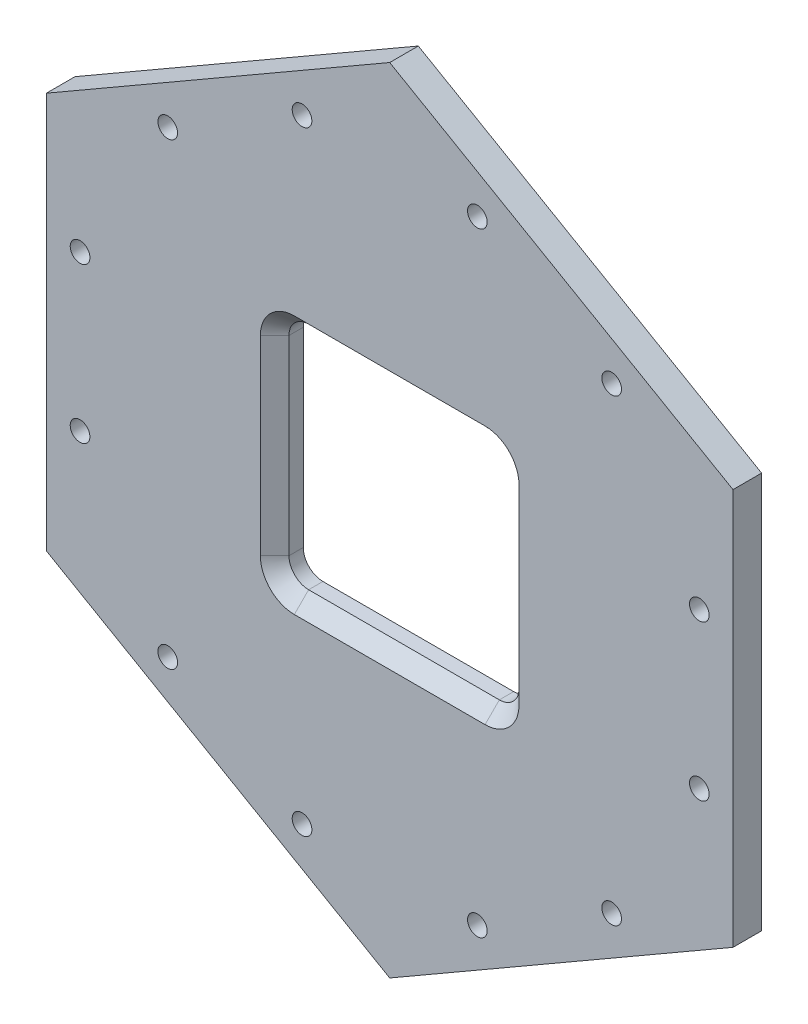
ISO-10303-21;
HEADER;
FILE_DESCRIPTION(('STEP AP214'),'2;1');
FILE_NAME('part.step','',(''),(''),'','','');
FILE_SCHEMA(('AUTOMOTIVE_DESIGN { 1 0 10303 214 1 1 1 1 }'));
ENDSEC;
DATA;
#1=APPLICATION_CONTEXT('core data for automotive mechanical design processes');
#2=APPLICATION_PROTOCOL_DEFINITION('international standard','automotive_design',2000,#1);
#3=PRODUCT_CONTEXT('',#1,'mechanical');
#4=PRODUCT('Part','Part','',(#3));
#5=PRODUCT_RELATED_PRODUCT_CATEGORY('part','',(#4));
#6=PRODUCT_DEFINITION_FORMATION('','',#4);
#7=PRODUCT_DEFINITION_CONTEXT('part definition',#1,'design');
#8=PRODUCT_DEFINITION('design','',#6,#7);
#9=PRODUCT_DEFINITION_SHAPE('','',#8);
#10=(LENGTH_UNIT() NAMED_UNIT(*) SI_UNIT(.MILLI.,.METRE.));
#11=(NAMED_UNIT(*) PLANE_ANGLE_UNIT() SI_UNIT($,.RADIAN.));
#12=(NAMED_UNIT(*) SI_UNIT($,.STERADIAN.) SOLID_ANGLE_UNIT());
#13=UNCERTAINTY_MEASURE_WITH_UNIT(LENGTH_MEASURE(1.E-05),#10,'distance_accuracy_value','');
#14=(GEOMETRIC_REPRESENTATION_CONTEXT(3) GLOBAL_UNCERTAINTY_ASSIGNED_CONTEXT((#13)) GLOBAL_UNIT_ASSIGNED_CONTEXT((#10,
#11,#12)) REPRESENTATION_CONTEXT('',''));
#15=CARTESIAN_POINT('',(0.,0.,0.));
#16=DIRECTION('',(0.,0.,1.));
#17=DIRECTION('',(1.,0.,0.));
#18=AXIS2_PLACEMENT_3D('',#15,#16,#17);
#19=CARTESIAN_POINT('',(-228.600000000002,131.982271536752,-9.52500000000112));
#20=DIRECTION('',(-1.,0.,0.));
#21=DIRECTION('',(0.,-1.,0.));
#22=AXIS2_PLACEMENT_3D('',#19,#20,#21);
#23=PLANE('',#22);
#24=DIRECTION('',(0.,-1.,0.));
#25=VECTOR('',#24,1.);
#26=CARTESIAN_POINT('',(-228.600000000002,131.982271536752,9.52499999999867));
#27=LINE('',#26,#25);
#28=CARTESIAN_POINT('',(-228.600000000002,131.982271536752,9.52499999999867));
#29=VERTEX_POINT('',#28);
#30=CARTESIAN_POINT('',(-228.600000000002,-131.982271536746,9.52499999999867));
#31=VERTEX_POINT('',#30);
#32=EDGE_CURVE('E298',#29,#31,#27,.T.);
#33=ORIENTED_EDGE('',*,*,#32,.F.);
#34=DIRECTION('',(0.,0.,1.));
#35=VECTOR('',#34,1.);
#36=CARTESIAN_POINT('',(-228.600000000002,131.982271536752,-9.52500000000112));
#37=LINE('',#36,#35);
#38=CARTESIAN_POINT('',(-228.600000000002,131.982271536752,-9.52500000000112));
#39=VERTEX_POINT('',#38);
#40=EDGE_CURVE('E366',#39,#29,#37,.T.);
#41=ORIENTED_EDGE('',*,*,#40,.F.);
#42=DIRECTION('',(0.,-1.,0.));
#43=VECTOR('',#42,1.);
#44=CARTESIAN_POINT('',(-228.600000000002,131.982271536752,-9.52500000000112));
#45=LINE('',#44,#43);
#46=CARTESIAN_POINT('',(-228.600000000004,-131.982271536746,-9.52500000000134));
#47=VERTEX_POINT('',#46);
#48=EDGE_CURVE('E318',#39,#47,#45,.T.);
#49=ORIENTED_EDGE('',*,*,#48,.T.);
#50=DIRECTION('',(0.,0.,1.));
#51=VECTOR('',#50,1.);
#52=CARTESIAN_POINT('',(-228.600000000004,-131.982271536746,-9.52500000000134));
#53=LINE('',#52,#51);
#54=EDGE_CURVE('E343',#47,#31,#53,.T.);
#55=ORIENTED_EDGE('',*,*,#54,.T.);
#56=EDGE_LOOP('',(#33,#41,#49,#55));
#57=FACE_BOUND('',#56,.T.);
#58=ADVANCED_FACE('F109',(#57),#23,.T.);
#59=CARTESIAN_POINT('',(-4.44089209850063E-13,263.964543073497,-9.52500000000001));
#60=DIRECTION('',(-0.5,0.86602540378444,0.));
#61=DIRECTION('',(-0.866025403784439,-0.500000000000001,0.));
#62=AXIS2_PLACEMENT_3D('',#59,#60,#61);
#63=PLANE('',#62);
#64=DIRECTION('',(-0.866025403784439,-0.500000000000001,0.));
#65=VECTOR('',#64,1.);
#66=CARTESIAN_POINT('',(-4.66293670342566E-12,263.964543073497,9.52500000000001));
#67=LINE('',#66,#65);
#68=CARTESIAN_POINT('',(-4.66293670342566E-12,263.964543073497,9.52500000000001));
#69=VERTEX_POINT('',#68);
#70=EDGE_CURVE('E323',#69,#29,#67,.T.);
#71=ORIENTED_EDGE('',*,*,#70,.F.);
#72=DIRECTION('',(0.,0.,1.));
#73=VECTOR('',#72,1.);
#74=CARTESIAN_POINT('',(-4.44089209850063E-13,263.964543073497,-9.52500000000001));
#75=LINE('',#74,#73);
#76=CARTESIAN_POINT('',(-4.44089209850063E-13,263.964543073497,-9.52500000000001));
#77=VERTEX_POINT('',#76);
#78=EDGE_CURVE('E369',#77,#69,#75,.T.);
#79=ORIENTED_EDGE('',*,*,#78,.F.);
#80=DIRECTION('',(-0.866025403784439,-0.500000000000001,0.));
#81=VECTOR('',#80,1.);
#82=CARTESIAN_POINT('',(-4.44089209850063E-13,263.964543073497,-9.52500000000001));
#83=LINE('',#82,#81);
#84=EDGE_CURVE('E339',#77,#39,#83,.T.);
#85=ORIENTED_EDGE('',*,*,#84,.T.);
#86=ORIENTED_EDGE('',*,*,#40,.T.);
#87=EDGE_LOOP('',(#71,#79,#85,#86));
#88=FACE_BOUND('',#87,.T.);
#89=ADVANCED_FACE('F577',(#88),#63,.T.);
#90=CARTESIAN_POINT('',(228.599999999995,131.982271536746,-9.52499999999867));
#91=DIRECTION('',(0.5,0.86602540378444,0.));
#92=DIRECTION('',(-0.866025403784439,0.500000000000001,0.));
#93=AXIS2_PLACEMENT_3D('',#90,#91,#92);
#94=PLANE('',#93);
#95=DIRECTION('',(-0.866025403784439,0.500000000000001,0.));
#96=VECTOR('',#95,1.);
#97=CARTESIAN_POINT('',(228.6,131.982271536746,9.52500000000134));
#98=LINE('',#97,#96);
#99=CARTESIAN_POINT('',(228.6,131.982271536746,9.52500000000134));
#100=VERTEX_POINT('',#99);
#101=EDGE_CURVE('E359',#100,#69,#98,.T.);
#102=ORIENTED_EDGE('',*,*,#101,.F.);
#103=DIRECTION('',(0.,0.,1.));
#104=VECTOR('',#103,1.);
#105=CARTESIAN_POINT('',(228.599999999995,131.982271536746,-9.52499999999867));
#106=LINE('',#105,#104);
#107=CARTESIAN_POINT('',(228.599999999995,131.982271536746,-9.52499999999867));
#108=VERTEX_POINT('',#107);
#109=EDGE_CURVE('E372',#108,#100,#106,.T.);
#110=ORIENTED_EDGE('',*,*,#109,.F.);
#111=DIRECTION('',(-0.866025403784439,0.500000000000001,0.));
#112=VECTOR('',#111,1.);
#113=CARTESIAN_POINT('',(228.599999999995,131.982271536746,-9.52499999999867));
#114=LINE('',#113,#112);
#115=EDGE_CURVE('E335',#108,#77,#114,.T.);
#116=ORIENTED_EDGE('',*,*,#115,.T.);
#117=ORIENTED_EDGE('',*,*,#78,.T.);
#118=EDGE_LOOP('',(#102,#110,#116,#117));
#119=FACE_BOUND('',#118,.T.);
#120=ADVANCED_FACE('F574',(#119),#94,.T.);
#121=CARTESIAN_POINT('',(228.599999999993,-131.982271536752,-9.52499999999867));
#122=DIRECTION('',(1.,0.,0.));
#123=DIRECTION('',(0.,0.,-1.));
#124=AXIS2_PLACEMENT_3D('',#121,#122,#123);
#125=PLANE('',#124);
#126=DIRECTION('',(0.,1.,0.));
#127=VECTOR('',#126,1.);
#128=CARTESIAN_POINT('',(228.599999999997,-131.982271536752,9.52500000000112));
#129=LINE('',#128,#127);
#130=CARTESIAN_POINT('',(228.599999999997,-131.982271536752,9.52500000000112));
#131=VERTEX_POINT('',#130);
#132=EDGE_CURVE('E355',#131,#100,#129,.T.);
#133=ORIENTED_EDGE('',*,*,#132,.F.);
#134=DIRECTION('',(0.,0.,1.));
#135=VECTOR('',#134,1.);
#136=CARTESIAN_POINT('',(228.599999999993,-131.982271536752,-9.52499999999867));
#137=LINE('',#136,#135);
#138=CARTESIAN_POINT('',(228.599999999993,-131.982271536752,-9.52499999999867));
#139=VERTEX_POINT('',#138);
#140=EDGE_CURVE('E375',#139,#131,#137,.T.);
#141=ORIENTED_EDGE('',*,*,#140,.F.);
#142=DIRECTION('',(0.,1.,0.));
#143=VECTOR('',#142,1.);
#144=CARTESIAN_POINT('',(228.599999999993,-131.982271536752,-9.52499999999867));
#145=LINE('',#144,#143);
#146=EDGE_CURVE('E331',#139,#108,#145,.T.);
#147=ORIENTED_EDGE('',*,*,#146,.T.);
#148=ORIENTED_EDGE('',*,*,#109,.T.);
#149=EDGE_LOOP('',(#133,#141,#147,#148));
#150=FACE_BOUND('',#149,.T.);
#151=ADVANCED_FACE('F570',(#150),#125,.T.);
#152=CARTESIAN_POINT('',(-6.66133814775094E-13,-263.964543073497,-9.52500000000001));
#153=DIRECTION('',(0.5,-0.86602540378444,0.));
#154=DIRECTION('',(0.866025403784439,0.500000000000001,0.));
#155=AXIS2_PLACEMENT_3D('',#152,#153,#154);
#156=PLANE('',#155);
#157=DIRECTION('',(0.866025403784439,0.500000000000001,0.));
#158=VECTOR('',#157,1.);
#159=CARTESIAN_POINT('',(-4.66293670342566E-12,-263.964543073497,9.52500000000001));
#160=LINE('',#159,#158);
#161=CARTESIAN_POINT('',(-4.66293670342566E-12,-263.964543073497,9.52500000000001));
#162=VERTEX_POINT('',#161);
#163=EDGE_CURVE('E351',#162,#131,#160,.T.);
#164=ORIENTED_EDGE('',*,*,#163,.F.);
#165=DIRECTION('',(0.,0.,1.));
#166=VECTOR('',#165,1.);
#167=CARTESIAN_POINT('',(-6.66133814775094E-13,-263.964543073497,-9.52500000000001));
#168=LINE('',#167,#166);
#169=CARTESIAN_POINT('',(-6.66133814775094E-13,-263.964543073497,-9.52500000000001));
#170=VERTEX_POINT('',#169);
#171=EDGE_CURVE('E378',#170,#162,#168,.T.);
#172=ORIENTED_EDGE('',*,*,#171,.F.);
#173=DIRECTION('',(0.866025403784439,0.500000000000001,0.));
#174=VECTOR('',#173,1.);
#175=CARTESIAN_POINT('',(-6.66133814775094E-13,-263.964543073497,-9.52500000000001));
#176=LINE('',#175,#174);
#177=EDGE_CURVE('E327',#170,#139,#176,.T.);
#178=ORIENTED_EDGE('',*,*,#177,.T.);
#179=ORIENTED_EDGE('',*,*,#140,.T.);
#180=EDGE_LOOP('',(#164,#172,#178,#179));
#181=FACE_BOUND('',#180,.T.);
#182=ADVANCED_FACE('F566',(#181),#156,.T.);
#183=CARTESIAN_POINT('',(-228.600000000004,-131.982271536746,-9.52500000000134));
#184=DIRECTION('',(-0.5,-0.86602540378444,0.));
#185=DIRECTION('',(0.866025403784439,-0.500000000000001,0.));
#186=AXIS2_PLACEMENT_3D('',#183,#184,#185);
#187=PLANE('',#186);
#188=DIRECTION('',(0.866025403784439,-0.500000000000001,0.));
#189=VECTOR('',#188,1.);
#190=CARTESIAN_POINT('',(-228.600000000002,-131.982271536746,9.52499999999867));
#191=LINE('',#190,#189);
#192=EDGE_CURVE('E347',#31,#162,#191,.T.);
#193=ORIENTED_EDGE('',*,*,#192,.F.);
#194=ORIENTED_EDGE('',*,*,#54,.F.);
#195=DIRECTION('',(0.866025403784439,-0.500000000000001,0.));
#196=VECTOR('',#195,1.);
#197=CARTESIAN_POINT('',(-228.600000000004,-131.982271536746,-9.52500000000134));
#198=LINE('',#197,#196);
#199=EDGE_CURVE('E322',#47,#170,#198,.T.);
#200=ORIENTED_EDGE('',*,*,#199,.T.);
#201=ORIENTED_EDGE('',*,*,#171,.T.);
#202=EDGE_LOOP('',(#193,#194,#200,#201));
#203=FACE_BOUND('',#202,.T.);
#204=ADVANCED_FACE('F562',(#203),#187,.T.);
#205=CARTESIAN_POINT('',(-4.44089209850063E-13,0.,-9.52500000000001));
#206=DIRECTION('',(0.,0.,1.));
#207=DIRECTION('',(1.,0.,0.));
#208=AXIS2_PLACEMENT_3D('',#205,#206,#207);
#209=PLANE('',#208);
#210=CARTESIAN_POINT('',(-58.3783411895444,-204.36743671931,-9.52500000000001));
#211=DIRECTION('',(0.,0.,1.));
#212=DIRECTION('',(1.,0.,0.));
#213=AXIS2_PLACEMENT_3D('',#210,#211,#212);
#214=CIRCLE('',#213,6.54843750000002);
#215=CARTESIAN_POINT('',(-51.8299036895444,-204.36743671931,-9.52500000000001));
#216=VERTEX_POINT('',#215);
#217=EDGE_CURVE('E497',#216,#216,#214,.T.);
#218=ORIENTED_EDGE('',*,*,#217,.T.);
#219=EDGE_LOOP('',(#218));
#220=FACE_BOUND('',#219,.T.);
#221=CARTESIAN_POINT('',(-206.176562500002,51.6265918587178,-9.52499999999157));
#222=DIRECTION('',(0.,0.,1.));
#223=DIRECTION('',(1.,0.,0.));
#224=AXIS2_PLACEMENT_3D('',#221,#222,#223);
#225=CIRCLE('',#224,6.5484375);
#226=CARTESIAN_POINT('',(-199.628125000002,51.6265918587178,-9.52499999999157));
#227=VERTEX_POINT('',#226);
#228=EDGE_CURVE('E488',#227,#227,#225,.T.);
#229=ORIENTED_EDGE('',*,*,#228,.T.);
#230=EDGE_LOOP('',(#229));
#231=FACE_BOUND('',#230,.T.);
#232=CARTESIAN_POINT('',(-206.176562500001,-51.6265918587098,-9.52499999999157));
#233=DIRECTION('',(0.,0.,1.));
#234=DIRECTION('',(1.,0.,0.));
#235=AXIS2_PLACEMENT_3D('',#232,#233,#234);
#236=CIRCLE('',#235,6.5484375);
#237=CARTESIAN_POINT('',(-199.628125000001,-51.6265918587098,-9.52499999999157));
#238=VERTEX_POINT('',#237);
#239=EDGE_CURVE('E479',#238,#238,#236,.T.);
#240=ORIENTED_EDGE('',*,*,#239,.T.);
#241=EDGE_LOOP('',(#240));
#242=FACE_BOUND('',#241,.T.);
#243=CARTESIAN_POINT('',(-58.3783411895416,204.367436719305,-9.52500000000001));
#244=DIRECTION('',(0.,0.,1.));
#245=DIRECTION('',(1.,0.,0.));
#246=AXIS2_PLACEMENT_3D('',#243,#244,#245);
#247=CIRCLE('',#246,6.5484375);
#248=CARTESIAN_POINT('',(-51.8299036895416,204.367436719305,-9.52500000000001));
#249=VERTEX_POINT('',#248);
#250=EDGE_CURVE('E489',#249,#249,#247,.T.);
#251=ORIENTED_EDGE('',*,*,#250,.T.);
#252=EDGE_LOOP('',(#251));
#253=FACE_BOUND('',#252,.T.);
#254=CARTESIAN_POINT('',(206.176562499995,51.6265918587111,-9.52500000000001));
#255=DIRECTION('',(0.,0.,1.));
#256=DIRECTION('',(1.,0.,0.));
#257=AXIS2_PLACEMENT_3D('',#254,#255,#256);
#258=CIRCLE('',#257,6.5484375);
#259=CARTESIAN_POINT('',(212.724999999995,51.6265918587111,-9.52500000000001));
#260=VERTEX_POINT('',#259);
#261=EDGE_CURVE('E529',#260,#260,#258,.T.);
#262=ORIENTED_EDGE('',*,*,#261,.T.);
#263=EDGE_LOOP('',(#262));
#264=FACE_BOUND('',#263,.T.);
#265=CARTESIAN_POINT('',(58.378341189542,-204.367436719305,-9.52500000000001));
#266=DIRECTION('',(0.,0.,1.));
#267=DIRECTION('',(1.,0.,0.));
#268=AXIS2_PLACEMENT_3D('',#265,#266,#267);
#269=CIRCLE('',#268,6.54843750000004);
#270=CARTESIAN_POINT('',(64.926778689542,-204.367436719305,-9.52500000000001));
#271=VERTEX_POINT('',#270);
#272=EDGE_CURVE('E522',#271,#271,#269,.T.);
#273=ORIENTED_EDGE('',*,*,#272,.T.);
#274=EDGE_LOOP('',(#273));
#275=FACE_BOUND('',#274,.T.);
#276=CARTESIAN_POINT('',(147.798221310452,-152.740844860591,-9.52499999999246));
#277=DIRECTION('',(0.,0.,1.));
#278=DIRECTION('',(1.,0.,0.));
#279=AXIS2_PLACEMENT_3D('',#276,#277,#278);
#280=CIRCLE('',#279,6.54843750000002);
#281=CARTESIAN_POINT('',(154.346658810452,-152.740844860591,-9.52499999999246));
#282=VERTEX_POINT('',#281);
#283=EDGE_CURVE('E513',#282,#282,#280,.T.);
#284=ORIENTED_EDGE('',*,*,#283,.T.);
#285=EDGE_LOOP('',(#284));
#286=FACE_BOUND('',#285,.T.);
#287=CARTESIAN_POINT('',(-147.798221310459,-152.740844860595,-9.52499999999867));
#288=DIRECTION('',(0.,0.,1.));
#289=DIRECTION('',(1.,0.,0.));
#290=AXIS2_PLACEMENT_3D('',#287,#288,#289);
#291=CIRCLE('',#290,6.54843750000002);
#292=CARTESIAN_POINT('',(-141.249783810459,-152.740844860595,-9.52499999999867));
#293=VERTEX_POINT('',#292);
#294=EDGE_CURVE('E506',#293,#293,#291,.T.);
#295=ORIENTED_EDGE('',*,*,#294,.T.);
#296=EDGE_LOOP('',(#295));
#297=FACE_BOUND('',#296,.T.);
#298=CARTESIAN_POINT('',(-147.798221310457,152.740844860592,-9.52499999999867));
#299=DIRECTION('',(0.,0.,1.));
#300=DIRECTION('',(1.,0.,0.));
#301=AXIS2_PLACEMENT_3D('',#298,#299,#300);
#302=CIRCLE('',#301,6.54843750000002);
#303=CARTESIAN_POINT('',(-141.249783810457,152.740844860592,-9.52499999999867));
#304=VERTEX_POINT('',#303);
#305=EDGE_CURVE('E869',#304,#304,#302,.T.);
#306=ORIENTED_EDGE('',*,*,#305,.T.);
#307=EDGE_LOOP('',(#306));
#308=FACE_BOUND('',#307,.T.);
#309=CARTESIAN_POINT('',(147.798221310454,152.740844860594,-9.52499999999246));
#310=DIRECTION('',(0.,0.,1.));
#311=DIRECTION('',(1.,0.,0.));
#312=AXIS2_PLACEMENT_3D('',#309,#310,#311);
#313=CIRCLE('',#312,6.5484375);
#314=CARTESIAN_POINT('',(154.346658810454,152.740844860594,-9.52499999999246));
#315=VERTEX_POINT('',#314);
#316=EDGE_CURVE('E473',#315,#315,#313,.T.);
#317=ORIENTED_EDGE('',*,*,#316,.T.);
#318=EDGE_LOOP('',(#317));
#319=FACE_BOUND('',#318,.T.);
#320=CARTESIAN_POINT('',(58.3783411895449,204.367436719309,-9.52500000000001));
#321=DIRECTION('',(0.,0.,1.));
#322=DIRECTION('',(1.,0.,0.));
#323=AXIS2_PLACEMENT_3D('',#320,#321,#322);
#324=CIRCLE('',#323,6.5484375);
#325=CARTESIAN_POINT('',(64.9267786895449,204.367436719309,-9.52500000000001));
#326=VERTEX_POINT('',#325);
#327=EDGE_CURVE('E458',#326,#326,#324,.T.);
#328=ORIENTED_EDGE('',*,*,#327,.T.);
#329=EDGE_LOOP('',(#328));
#330=FACE_BOUND('',#329,.T.);
#331=CARTESIAN_POINT('',(206.176562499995,-51.6265918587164,-9.52500000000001));
#332=DIRECTION('',(0.,0.,1.));
#333=DIRECTION('',(1.,0.,0.));
#334=AXIS2_PLACEMENT_3D('',#331,#332,#333);
#335=CIRCLE('',#334,6.5484375);
#336=CARTESIAN_POINT('',(212.724999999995,-51.6265918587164,-9.52500000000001));
#337=VERTEX_POINT('',#336);
#338=EDGE_CURVE('E267',#337,#337,#335,.T.);
#339=ORIENTED_EDGE('',*,*,#338,.T.);
#340=EDGE_LOOP('',(#339));
#341=FACE_BOUND('',#340,.T.);
#342=DIRECTION('',(0.,-1.,0.));
#343=VECTOR('',#342,1.);
#344=CARTESIAN_POINT('',(-76.5810000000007,63.5000000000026,-9.52499999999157));
#345=LINE('',#344,#343);
#346=CARTESIAN_POINT('',(-76.5810000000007,63.5000000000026,-9.52499999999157));
#347=VERTEX_POINT('',#346);
#348=CARTESIAN_POINT('',(-76.5810000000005,-63.4999999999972,-9.52499999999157));
#349=VERTEX_POINT('',#348);
#350=EDGE_CURVE('E250',#347,#349,#345,.T.);
#351=ORIENTED_EDGE('',*,*,#350,.T.);
#352=CARTESIAN_POINT('',(-63.5000000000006,-63.4999999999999,-9.52500000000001));
#353=DIRECTION('',(0.,0.,1.));
#354=DIRECTION('',(1.,0.,0.));
#355=AXIS2_PLACEMENT_3D('',#352,#353,#354);
#356=CIRCLE('',#355,13.081);
#357=CARTESIAN_POINT('',(-63.5000000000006,-76.5810000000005,-9.52500000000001));
#358=VERTEX_POINT('',#357);
#359=EDGE_CURVE('E243',#349,#358,#356,.T.);
#360=ORIENTED_EDGE('',*,*,#359,.T.);
#361=DIRECTION('',(1.,0.,0.));
#362=VECTOR('',#361,1.);
#363=CARTESIAN_POINT('',(-63.5000000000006,-76.5810000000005,-9.52500000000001));
#364=LINE('',#363,#362);
#365=CARTESIAN_POINT('',(63.4999999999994,-76.581,-9.52500000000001));
#366=VERTEX_POINT('',#365);
#367=EDGE_CURVE('E254',#358,#366,#364,.T.);
#368=ORIENTED_EDGE('',*,*,#367,.T.);
#369=CARTESIAN_POINT('',(63.4999999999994,-63.5000000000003,-9.52500000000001));
#370=DIRECTION('',(0.,0.,1.));
#371=DIRECTION('',(1.,0.,0.));
#372=AXIS2_PLACEMENT_3D('',#369,#370,#371);
#373=CIRCLE('',#372,13.081);
#374=CARTESIAN_POINT('',(76.5809999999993,-63.5000000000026,-9.52500000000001));
#375=VERTEX_POINT('',#374);
#376=EDGE_CURVE('E260',#366,#375,#373,.T.);
#377=ORIENTED_EDGE('',*,*,#376,.T.);
#378=DIRECTION('',(0.,1.,0.));
#379=VECTOR('',#378,1.);
#380=CARTESIAN_POINT('',(76.5809999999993,-63.5000000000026,-9.52500000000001));
#381=LINE('',#380,#379);
#382=CARTESIAN_POINT('',(76.5809999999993,63.4999999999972,-9.52500000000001));
#383=VERTEX_POINT('',#382);
#384=EDGE_CURVE('E278',#375,#383,#381,.T.);
#385=ORIENTED_EDGE('',*,*,#384,.T.);
#386=CARTESIAN_POINT('',(63.4999999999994,63.4999999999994,-9.52500000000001));
#387=DIRECTION('',(0.,0.,1.));
#388=DIRECTION('',(1.,0.,0.));
#389=AXIS2_PLACEMENT_3D('',#386,#387,#388);
#390=CIRCLE('',#389,13.081);
#391=CARTESIAN_POINT('',(63.4999999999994,76.581,-9.52500000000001));
#392=VERTEX_POINT('',#391);
#393=EDGE_CURVE('E282',#383,#392,#390,.T.);
#394=ORIENTED_EDGE('',*,*,#393,.T.);
#395=DIRECTION('',(-1.,0.,0.));
#396=VECTOR('',#395,1.);
#397=CARTESIAN_POINT('',(63.4999999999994,76.581,-9.52500000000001));
#398=LINE('',#397,#396);
#399=CARTESIAN_POINT('',(-63.5000000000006,76.5809999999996,-9.52500000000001));
#400=VERTEX_POINT('',#399);
#401=EDGE_CURVE('E286',#392,#400,#398,.T.);
#402=ORIENTED_EDGE('',*,*,#401,.T.);
#403=CARTESIAN_POINT('',(-63.5000000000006,63.4999999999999,-9.52500000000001));
#404=DIRECTION('',(0.,0.,1.));
#405=DIRECTION('',(1.,0.,0.));
#406=AXIS2_PLACEMENT_3D('',#403,#404,#405);
#407=CIRCLE('',#406,13.081);
#408=EDGE_CURVE('E290',#400,#347,#407,.T.);
#409=ORIENTED_EDGE('',*,*,#408,.T.);
#410=EDGE_LOOP('',(#351,#360,#368,#377,#385,#394,#402,#409));
#411=FACE_BOUND('',#410,.T.);
#412=ORIENTED_EDGE('',*,*,#48,.F.);
#413=ORIENTED_EDGE('',*,*,#84,.F.);
#414=ORIENTED_EDGE('',*,*,#115,.F.);
#415=ORIENTED_EDGE('',*,*,#146,.F.);
#416=ORIENTED_EDGE('',*,*,#177,.F.);
#417=ORIENTED_EDGE('',*,*,#199,.F.);
#418=EDGE_LOOP('',(#412,#413,#414,#415,#416,#417));
#419=FACE_BOUND('',#418,.T.);
#420=ADVANCED_FACE('F262',(#220,#231,#242,#253,#264,#275,#286,#297,#308,#319,#330,#341,#411,
#419),#209,.F.);
#421=CARTESIAN_POINT('',(-4.66293670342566E-12,0.,9.52500000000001));
#422=DIRECTION('',(0.,0.,1.));
#423=DIRECTION('',(1.,0.,0.));
#424=AXIS2_PLACEMENT_3D('',#421,#422,#423);
#425=PLANE('',#424);
#426=DIRECTION('',(-1.,0.,0.));
#427=VECTOR('',#426,1.);
#428=CARTESIAN_POINT('',(-63.5000000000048,-86.1059999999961,9.52500000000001));
#429=LINE('',#428,#427);
#430=CARTESIAN_POINT('',(63.4999999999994,-86.105999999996,9.52500000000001));
#431=VERTEX_POINT('',#430);
#432=CARTESIAN_POINT('',(-63.5000000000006,-86.1059999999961,9.52500000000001));
#433=VERTEX_POINT('',#432);
#434=EDGE_CURVE('E403',#431,#433,#429,.T.);
#435=ORIENTED_EDGE('',*,*,#434,.T.);
#436=CARTESIAN_POINT('',(-63.5000000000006,-63.4999999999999,9.52500000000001));
#437=DIRECTION('',(0.,0.,1.));
#438=DIRECTION('',(1.,0.,0.));
#439=AXIS2_PLACEMENT_3D('',#436,#437,#438);
#440=CIRCLE('',#439,22.6059999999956);
#441=CARTESIAN_POINT('',(-86.1059999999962,-63.4999999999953,9.52500000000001));
#442=VERTEX_POINT('',#441);
#443=EDGE_CURVE('E406',#433,#442,#440,.F.);
#444=ORIENTED_EDGE('',*,*,#443,.T.);
#445=DIRECTION('',(0.,1.,0.));
#446=VECTOR('',#445,1.);
#447=CARTESIAN_POINT('',(-86.1059999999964,63.5000000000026,9.52500000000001));
#448=LINE('',#447,#446);
#449=CARTESIAN_POINT('',(-86.1059999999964,63.5000000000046,9.52500000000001));
#450=VERTEX_POINT('',#449);
#451=EDGE_CURVE('E385',#442,#450,#448,.T.);
#452=ORIENTED_EDGE('',*,*,#451,.T.);
#453=CARTESIAN_POINT('',(-63.5000000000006,63.4999999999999,9.52500000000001));
#454=DIRECTION('',(0.,0.,1.));
#455=DIRECTION('',(1.,0.,0.));
#456=AXIS2_PLACEMENT_3D('',#453,#454,#455);
#457=CIRCLE('',#456,22.6059999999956);
#458=CARTESIAN_POINT('',(-63.5000000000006,86.1059999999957,9.52500000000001));
#459=VERTEX_POINT('',#458);
#460=EDGE_CURVE('E388',#450,#459,#457,.F.);
#461=ORIENTED_EDGE('',*,*,#460,.T.);
#462=DIRECTION('',(1.,0.,0.));
#463=VECTOR('',#462,1.);
#464=CARTESIAN_POINT('',(63.4999999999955,86.1059999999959,9.52500000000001));
#465=LINE('',#464,#463);
#466=CARTESIAN_POINT('',(63.4999999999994,86.1059999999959,9.52500000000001));
#467=VERTEX_POINT('',#466);
#468=EDGE_CURVE('E391',#459,#467,#465,.T.);
#469=ORIENTED_EDGE('',*,*,#468,.T.);
#470=CARTESIAN_POINT('',(63.4999999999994,63.4999999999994,9.52500000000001));
#471=DIRECTION('',(0.,0.,1.));
#472=DIRECTION('',(1.,0.,0.));
#473=AXIS2_PLACEMENT_3D('',#470,#471,#472);
#474=CIRCLE('',#473,22.6059999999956);
#475=CARTESIAN_POINT('',(86.1059999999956,63.4999999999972,9.52500000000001));
#476=VERTEX_POINT('',#475);
#477=EDGE_CURVE('E394',#467,#476,#474,.F.);
#478=ORIENTED_EDGE('',*,*,#477,.T.);
#479=DIRECTION('',(0.,-1.,0.));
#480=VECTOR('',#479,1.);
#481=CARTESIAN_POINT('',(86.1059999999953,-63.5000000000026,9.52500000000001));
#482=LINE('',#481,#480);
#483=CARTESIAN_POINT('',(86.1059999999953,-63.5000000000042,9.52500000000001));
#484=VERTEX_POINT('',#483);
#485=EDGE_CURVE('E397',#476,#484,#482,.T.);
#486=ORIENTED_EDGE('',*,*,#485,.T.);
#487=CARTESIAN_POINT('',(63.4999999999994,-63.5000000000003,9.52500000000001));
#488=DIRECTION('',(0.,0.,1.));
#489=DIRECTION('',(1.,0.,0.));
#490=AXIS2_PLACEMENT_3D('',#487,#488,#489);
#491=CIRCLE('',#490,22.6059999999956);
#492=EDGE_CURVE('E400',#484,#431,#491,.F.);
#493=ORIENTED_EDGE('',*,*,#492,.T.);
#494=EDGE_LOOP('',(#435,#444,#452,#461,#469,#478,#486,#493));
#495=FACE_BOUND('',#494,.T.);
#496=CARTESIAN_POINT('',(-58.3783411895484,-204.36743671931,9.52500000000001));
#497=DIRECTION('',(0.,0.,1.));
#498=DIRECTION('',(1.,0.,0.));
#499=AXIS2_PLACEMENT_3D('',#496,#497,#498);
#500=CIRCLE('',#499,6.54843750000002);
#501=CARTESIAN_POINT('',(-51.8299036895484,-204.36743671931,9.52500000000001));
#502=VERTEX_POINT('',#501);
#503=EDGE_CURVE('E501',#502,#502,#500,.T.);
#504=ORIENTED_EDGE('',*,*,#503,.F.);
#505=EDGE_LOOP('',(#504));
#506=FACE_BOUND('',#505,.T.);
#507=CARTESIAN_POINT('',(-206.176562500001,51.6265918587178,9.52500000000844));
#508=DIRECTION('',(0.,0.,1.));
#509=DIRECTION('',(1.,0.,0.));
#510=AXIS2_PLACEMENT_3D('',#507,#508,#509);
#511=CIRCLE('',#510,6.5484375);
#512=CARTESIAN_POINT('',(-199.628125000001,51.6265918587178,9.52500000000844));
#513=VERTEX_POINT('',#512);
#514=EDGE_CURVE('E502',#513,#513,#511,.T.);
#515=ORIENTED_EDGE('',*,*,#514,.F.);
#516=EDGE_LOOP('',(#515));
#517=FACE_BOUND('',#516,.T.);
#518=CARTESIAN_POINT('',(-206.1765625,-51.6265918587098,9.52500000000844));
#519=DIRECTION('',(0.,0.,1.));
#520=DIRECTION('',(1.,0.,0.));
#521=AXIS2_PLACEMENT_3D('',#518,#519,#520);
#522=CIRCLE('',#521,6.5484375);
#523=CARTESIAN_POINT('',(-199.628125,-51.6265918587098,9.52500000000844));
#524=VERTEX_POINT('',#523);
#525=EDGE_CURVE('E483',#524,#524,#522,.T.);
#526=ORIENTED_EDGE('',*,*,#525,.F.);
#527=EDGE_LOOP('',(#526));
#528=FACE_BOUND('',#527,.T.);
#529=CARTESIAN_POINT('',(-58.3783411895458,204.367436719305,9.52500000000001));
#530=DIRECTION('',(0.,0.,1.));
#531=DIRECTION('',(1.,0.,0.));
#532=AXIS2_PLACEMENT_3D('',#529,#530,#531);
#533=CIRCLE('',#532,6.5484375);
#534=CARTESIAN_POINT('',(-51.8299036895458,204.367436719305,9.52500000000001));
#535=VERTEX_POINT('',#534);
#536=EDGE_CURVE('E484',#535,#535,#533,.T.);
#537=ORIENTED_EDGE('',*,*,#536,.F.);
#538=EDGE_LOOP('',(#537));
#539=FACE_BOUND('',#538,.T.);
#540=CARTESIAN_POINT('',(206.1765625,51.6265918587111,9.52500000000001));
#541=DIRECTION('',(0.,0.,1.));
#542=DIRECTION('',(1.,0.,0.));
#543=AXIS2_PLACEMENT_3D('',#540,#541,#542);
#544=CIRCLE('',#543,6.5484375);
#545=CARTESIAN_POINT('',(212.725,51.6265918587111,9.52500000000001));
#546=VERTEX_POINT('',#545);
#547=EDGE_CURVE('E533',#546,#546,#544,.T.);
#548=ORIENTED_EDGE('',*,*,#547,.F.);
#549=EDGE_LOOP('',(#548));
#550=FACE_BOUND('',#549,.T.);
#551=CARTESIAN_POINT('',(58.3783411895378,-204.367436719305,9.52500000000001));
#552=DIRECTION('',(0.,0.,1.));
#553=DIRECTION('',(1.,0.,0.));
#554=AXIS2_PLACEMENT_3D('',#551,#552,#553);
#555=CIRCLE('',#554,6.54843750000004);
#556=CARTESIAN_POINT('',(64.9267786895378,-204.367436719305,9.52500000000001));
#557=VERTEX_POINT('',#556);
#558=EDGE_CURVE('E534',#557,#557,#555,.T.);
#559=ORIENTED_EDGE('',*,*,#558,.F.);
#560=EDGE_LOOP('',(#559));
#561=FACE_BOUND('',#560,.T.);
#562=CARTESIAN_POINT('',(147.798221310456,-152.740844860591,9.52500000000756));
#563=DIRECTION('',(0.,0.,1.));
#564=DIRECTION('',(1.,0.,0.));
#565=AXIS2_PLACEMENT_3D('',#562,#563,#564);
#566=CIRCLE('',#565,6.54843750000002);
#567=CARTESIAN_POINT('',(154.346658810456,-152.740844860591,9.52500000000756));
#568=VERTEX_POINT('',#567);
#569=EDGE_CURVE('E517',#568,#568,#566,.T.);
#570=ORIENTED_EDGE('',*,*,#569,.F.);
#571=EDGE_LOOP('',(#570));
#572=FACE_BOUND('',#571,.T.);
#573=CARTESIAN_POINT('',(-147.798221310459,-152.740844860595,9.52500000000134));
#574=DIRECTION('',(0.,0.,1.));
#575=DIRECTION('',(1.,0.,0.));
#576=AXIS2_PLACEMENT_3D('',#573,#574,#575);
#577=CIRCLE('',#576,6.54843750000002);
#578=CARTESIAN_POINT('',(-141.249783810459,-152.740844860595,9.52500000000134));
#579=VERTEX_POINT('',#578);
#580=EDGE_CURVE('E518',#579,#579,#577,.T.);
#581=ORIENTED_EDGE('',*,*,#580,.F.);
#582=EDGE_LOOP('',(#581));
#583=FACE_BOUND('',#582,.T.);
#584=CARTESIAN_POINT('',(-147.798221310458,152.740844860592,9.52500000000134));
#585=DIRECTION('',(0.,0.,1.));
#586=DIRECTION('',(1.,0.,0.));
#587=AXIS2_PLACEMENT_3D('',#584,#585,#586);
#588=CIRCLE('',#587,6.54843750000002);
#589=CARTESIAN_POINT('',(-141.249783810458,152.740844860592,9.52500000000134));
#590=VERTEX_POINT('',#589);
#591=EDGE_CURVE('E493',#590,#590,#588,.T.);
#592=ORIENTED_EDGE('',*,*,#591,.F.);
#593=EDGE_LOOP('',(#592));
#594=FACE_BOUND('',#593,.T.);
#595=CARTESIAN_POINT('',(147.798221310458,152.740844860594,9.52500000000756));
#596=DIRECTION('',(0.,0.,1.));
#597=DIRECTION('',(1.,0.,0.));
#598=AXIS2_PLACEMENT_3D('',#595,#596,#597);
#599=CIRCLE('',#598,6.5484375);
#600=CARTESIAN_POINT('',(154.346658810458,152.740844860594,9.52500000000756));
#601=VERTEX_POINT('',#600);
#602=EDGE_CURVE('E476',#601,#601,#599,.T.);
#603=ORIENTED_EDGE('',*,*,#602,.F.);
#604=EDGE_LOOP('',(#603));
#605=FACE_BOUND('',#604,.T.);
#606=CARTESIAN_POINT('',(58.3783411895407,204.367436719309,9.52500000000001));
#607=DIRECTION('',(0.,0.,1.));
#608=DIRECTION('',(1.,0.,0.));
#609=AXIS2_PLACEMENT_3D('',#606,#607,#608);
#610=CIRCLE('',#609,6.5484375);
#611=CARTESIAN_POINT('',(64.9267786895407,204.367436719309,9.52500000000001));
#612=VERTEX_POINT('',#611);
#613=EDGE_CURVE('E466',#612,#612,#610,.T.);
#614=ORIENTED_EDGE('',*,*,#613,.F.);
#615=EDGE_LOOP('',(#614));
#616=FACE_BOUND('',#615,.T.);
#617=CARTESIAN_POINT('',(206.1765625,-51.6265918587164,9.52500000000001));
#618=DIRECTION('',(0.,0.,1.));
#619=DIRECTION('',(1.,0.,0.));
#620=AXIS2_PLACEMENT_3D('',#617,#618,#619);
#621=CIRCLE('',#620,6.5484375);
#622=CARTESIAN_POINT('',(212.725,-51.6265918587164,9.52500000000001));
#623=VERTEX_POINT('',#622);
#624=EDGE_CURVE('E272',#623,#623,#621,.T.);
#625=ORIENTED_EDGE('',*,*,#624,.F.);
#626=EDGE_LOOP('',(#625));
#627=FACE_BOUND('',#626,.T.);
#628=ORIENTED_EDGE('',*,*,#32,.T.);
#629=ORIENTED_EDGE('',*,*,#192,.T.);
#630=ORIENTED_EDGE('',*,*,#163,.T.);
#631=ORIENTED_EDGE('',*,*,#132,.T.);
#632=ORIENTED_EDGE('',*,*,#101,.T.);
#633=ORIENTED_EDGE('',*,*,#70,.T.);
#634=EDGE_LOOP('',(#628,#629,#630,#631,#632,#633));
#635=FACE_BOUND('',#634,.T.);
#636=ADVANCED_FACE('F550',(#495,#506,#517,#528,#539,#550,#561,#572,#583,#594,#605,#616,#627,
#635),#425,.T.);
#637=CARTESIAN_POINT('',(-63.5000000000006,-63.4999999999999,-9.52500000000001));
#638=DIRECTION('',(0.,0.,1.));
#639=DIRECTION('',(1.,0.,0.));
#640=AXIS2_PLACEMENT_3D('',#637,#638,#639);
#641=CYLINDRICAL_SURFACE('',#640,13.081);
#642=DIRECTION('',(0.,0.,1.));
#643=VECTOR('',#642,1.);
#644=CARTESIAN_POINT('',(-76.5810000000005,-63.4999999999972,-9.52499999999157));
#645=LINE('',#644,#643);
#646=CARTESIAN_POINT('',(-76.581,-63.4999999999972,4.44089209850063E-12));
#647=VERTEX_POINT('',#646);
#648=EDGE_CURVE('E295',#349,#647,#645,.T.);
#649=ORIENTED_EDGE('',*,*,#648,.T.);
#650=CARTESIAN_POINT('',(-63.5000000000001,-63.4999999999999,4.44089209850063E-12));
#651=DIRECTION('',(0.,0.,1.));
#652=DIRECTION('',(1.,0.,0.));
#653=AXIS2_PLACEMENT_3D('',#650,#651,#652);
#654=CIRCLE('',#653,13.081);
#655=CARTESIAN_POINT('',(-63.5000000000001,-76.5810000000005,4.44089209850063E-12));
#656=VERTEX_POINT('',#655);
#657=EDGE_CURVE('E246',#647,#656,#654,.T.);
#658=ORIENTED_EDGE('',*,*,#657,.T.);
#659=DIRECTION('',(0.,0.,1.));
#660=VECTOR('',#659,1.);
#661=CARTESIAN_POINT('',(-63.5000000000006,-76.5810000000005,-9.52500000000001));
#662=LINE('',#661,#660);
#663=EDGE_CURVE('E238',#358,#656,#662,.T.);
#664=ORIENTED_EDGE('',*,*,#663,.F.);
#665=ORIENTED_EDGE('',*,*,#359,.F.);
#666=EDGE_LOOP('',(#649,#658,#664,#665));
#667=FACE_BOUND('',#666,.T.);
#668=ADVANCED_FACE('F241',(#667),#641,.F.);
#669=CARTESIAN_POINT('',(-76.5810000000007,63.5000000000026,-9.52499999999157));
#670=DIRECTION('',(-1.,0.,0.));
#671=DIRECTION('',(0.,-1.,0.));
#672=AXIS2_PLACEMENT_3D('',#669,#670,#671);
#673=PLANE('',#672);
#674=DIRECTION('',(0.,0.,1.));
#675=VECTOR('',#674,1.);
#676=CARTESIAN_POINT('',(-76.5810000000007,63.5000000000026,-9.52499999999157));
#677=LINE('',#676,#675);
#678=CARTESIAN_POINT('',(-76.5810000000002,63.5000000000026,4.44089209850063E-12));
#679=VERTEX_POINT('',#678);
#680=EDGE_CURVE('E299',#347,#679,#677,.T.);
#681=ORIENTED_EDGE('',*,*,#680,.T.);
#682=DIRECTION('',(0.,-1.,0.));
#683=VECTOR('',#682,1.);
#684=CARTESIAN_POINT('',(-76.5810000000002,-63.4999999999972,4.44089209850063E-12));
#685=LINE('',#684,#683);
#686=EDGE_CURVE('E12',#679,#647,#685,.T.);
#687=ORIENTED_EDGE('',*,*,#686,.T.);
#688=ORIENTED_EDGE('',*,*,#648,.F.);
#689=ORIENTED_EDGE('',*,*,#350,.F.);
#690=EDGE_LOOP('',(#681,#687,#688,#689));
#691=FACE_BOUND('',#690,.T.);
#692=ADVANCED_FACE('F668',(#691),#673,.F.);
#693=CARTESIAN_POINT('',(-63.5000000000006,63.4999999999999,-9.52500000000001));
#694=DIRECTION('',(0.,0.,1.));
#695=DIRECTION('',(1.,0.,0.));
#696=AXIS2_PLACEMENT_3D('',#693,#694,#695);
#697=CYLINDRICAL_SURFACE('',#696,13.081);
#698=DIRECTION('',(0.,0.,1.));
#699=VECTOR('',#698,1.);
#700=CARTESIAN_POINT('',(-63.5000000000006,76.5809999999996,-9.52500000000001));
#701=LINE('',#700,#699);
#702=CARTESIAN_POINT('',(-63.5000000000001,76.5809999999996,4.44089209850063E-12));
#703=VERTEX_POINT('',#702);
#704=EDGE_CURVE('E302',#400,#703,#701,.T.);
#705=ORIENTED_EDGE('',*,*,#704,.T.);
#706=CARTESIAN_POINT('',(-63.5000000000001,63.4999999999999,4.44089209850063E-12));
#707=DIRECTION('',(0.,0.,1.));
#708=DIRECTION('',(1.,0.,0.));
#709=AXIS2_PLACEMENT_3D('',#706,#707,#708);
#710=CIRCLE('',#709,13.081);
#711=EDGE_CURVE('E120',#703,#679,#710,.T.);
#712=ORIENTED_EDGE('',*,*,#711,.T.);
#713=ORIENTED_EDGE('',*,*,#680,.F.);
#714=ORIENTED_EDGE('',*,*,#408,.F.);
#715=EDGE_LOOP('',(#705,#712,#713,#714));
#716=FACE_BOUND('',#715,.T.);
#717=ADVANCED_FACE('F670',(#716),#697,.F.);
#718=CARTESIAN_POINT('',(63.4999999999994,76.581,-9.52500000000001));
#719=DIRECTION('',(0.,1.,0.));
#720=DIRECTION('',(0.,0.,1.));
#721=AXIS2_PLACEMENT_3D('',#718,#719,#720);
#722=PLANE('',#721);
#723=DIRECTION('',(0.,0.,1.));
#724=VECTOR('',#723,1.);
#725=CARTESIAN_POINT('',(63.4999999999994,76.581,-9.52500000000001));
#726=LINE('',#725,#724);
#727=CARTESIAN_POINT('',(63.4999999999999,76.581,4.44089209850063E-12));
#728=VERTEX_POINT('',#727);
#729=EDGE_CURVE('E305',#392,#728,#726,.T.);
#730=ORIENTED_EDGE('',*,*,#729,.T.);
#731=DIRECTION('',(-1.,0.,0.));
#732=VECTOR('',#731,1.);
#733=CARTESIAN_POINT('',(-63.5000000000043,76.581,4.44089209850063E-12));
#734=LINE('',#733,#732);
#735=EDGE_CURVE('E135',#728,#703,#734,.T.);
#736=ORIENTED_EDGE('',*,*,#735,.T.);
#737=ORIENTED_EDGE('',*,*,#704,.F.);
#738=ORIENTED_EDGE('',*,*,#401,.F.);
#739=EDGE_LOOP('',(#730,#736,#737,#738));
#740=FACE_BOUND('',#739,.T.);
#741=ADVANCED_FACE('F673',(#740),#722,.F.);
#742=CARTESIAN_POINT('',(63.4999999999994,63.4999999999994,-9.52500000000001));
#743=DIRECTION('',(0.,0.,1.));
#744=DIRECTION('',(1.,0.,0.));
#745=AXIS2_PLACEMENT_3D('',#742,#743,#744);
#746=CYLINDRICAL_SURFACE('',#745,13.081);
#747=DIRECTION('',(0.,0.,1.));
#748=VECTOR('',#747,1.);
#749=CARTESIAN_POINT('',(76.5809999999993,63.4999999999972,-9.52500000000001));
#750=LINE('',#749,#748);
#751=CARTESIAN_POINT('',(76.5809999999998,63.4999999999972,4.44089209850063E-12));
#752=VERTEX_POINT('',#751);
#753=EDGE_CURVE('E308',#383,#752,#750,.T.);
#754=ORIENTED_EDGE('',*,*,#753,.T.);
#755=CARTESIAN_POINT('',(63.4999999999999,63.4999999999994,4.44089209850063E-12));
#756=DIRECTION('',(0.,0.,1.));
#757=DIRECTION('',(1.,0.,0.));
#758=AXIS2_PLACEMENT_3D('',#755,#756,#757);
#759=CIRCLE('',#758,13.081);
#760=EDGE_CURVE('E419',#752,#728,#759,.T.);
#761=ORIENTED_EDGE('',*,*,#760,.T.);
#762=ORIENTED_EDGE('',*,*,#729,.F.);
#763=ORIENTED_EDGE('',*,*,#393,.F.);
#764=EDGE_LOOP('',(#754,#761,#762,#763));
#765=FACE_BOUND('',#764,.T.);
#766=ADVANCED_FACE('F675',(#765),#746,.F.);
#767=CARTESIAN_POINT('',(76.5809999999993,-63.5000000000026,-9.52500000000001));
#768=DIRECTION('',(1.,0.,0.));
#769=DIRECTION('',(0.,1.,0.));
#770=AXIS2_PLACEMENT_3D('',#767,#768,#769);
#771=PLANE('',#770);
#772=DIRECTION('',(0.,0.,1.));
#773=VECTOR('',#772,1.);
#774=CARTESIAN_POINT('',(76.5809999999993,-63.5000000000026,-9.52500000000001));
#775=LINE('',#774,#773);
#776=CARTESIAN_POINT('',(76.5809999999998,-63.5000000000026,4.44089209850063E-12));
#777=VERTEX_POINT('',#776);
#778=EDGE_CURVE('E312',#375,#777,#775,.T.);
#779=ORIENTED_EDGE('',*,*,#778,.T.);
#780=DIRECTION('',(0.,1.,0.));
#781=VECTOR('',#780,1.);
#782=CARTESIAN_POINT('',(76.5809999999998,63.4999999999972,4.44089209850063E-12));
#783=LINE('',#782,#781);
#784=EDGE_CURVE('E416',#777,#752,#783,.T.);
#785=ORIENTED_EDGE('',*,*,#784,.T.);
#786=ORIENTED_EDGE('',*,*,#753,.F.);
#787=ORIENTED_EDGE('',*,*,#384,.F.);
#788=EDGE_LOOP('',(#779,#785,#786,#787));
#789=FACE_BOUND('',#788,.T.);
#790=ADVANCED_FACE('F678',(#789),#771,.F.);
#791=CARTESIAN_POINT('',(63.4999999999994,-63.5000000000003,-9.52500000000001));
#792=DIRECTION('',(0.,0.,1.));
#793=DIRECTION('',(1.,0.,0.));
#794=AXIS2_PLACEMENT_3D('',#791,#792,#793);
#795=CYLINDRICAL_SURFACE('',#794,13.081);
#796=DIRECTION('',(0.,0.,1.));
#797=VECTOR('',#796,1.);
#798=CARTESIAN_POINT('',(63.4999999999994,-76.581,-9.52500000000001));
#799=LINE('',#798,#797);
#800=CARTESIAN_POINT('',(63.4999999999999,-76.581,4.44089209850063E-12));
#801=VERTEX_POINT('',#800);
#802=EDGE_CURVE('E249',#366,#801,#799,.T.);
#803=ORIENTED_EDGE('',*,*,#802,.T.);
#804=CARTESIAN_POINT('',(63.4999999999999,-63.5000000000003,4.44089209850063E-12));
#805=DIRECTION('',(0.,0.,1.));
#806=DIRECTION('',(1.,0.,0.));
#807=AXIS2_PLACEMENT_3D('',#804,#805,#806);
#808=CIRCLE('',#807,13.081);
#809=EDGE_CURVE('E413',#801,#777,#808,.T.);
#810=ORIENTED_EDGE('',*,*,#809,.T.);
#811=ORIENTED_EDGE('',*,*,#778,.F.);
#812=ORIENTED_EDGE('',*,*,#376,.F.);
#813=EDGE_LOOP('',(#803,#810,#811,#812));
#814=FACE_BOUND('',#813,.T.);
#815=ADVANCED_FACE('F685',(#814),#795,.F.);
#816=CARTESIAN_POINT('',(-63.5000000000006,-76.5810000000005,-9.52500000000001));
#817=DIRECTION('',(0.,-1.,0.));
#818=DIRECTION('',(0.,0.,-1.));
#819=AXIS2_PLACEMENT_3D('',#816,#817,#818);
#820=PLANE('',#819);
#821=ORIENTED_EDGE('',*,*,#663,.T.);
#822=DIRECTION('',(1.,0.,0.));
#823=VECTOR('',#822,1.);
#824=CARTESIAN_POINT('',(63.4999999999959,-76.5810000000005,4.44089209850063E-12));
#825=LINE('',#824,#823);
#826=EDGE_CURVE('E410',#656,#801,#825,.T.);
#827=ORIENTED_EDGE('',*,*,#826,.T.);
#828=ORIENTED_EDGE('',*,*,#802,.F.);
#829=ORIENTED_EDGE('',*,*,#367,.F.);
#830=EDGE_LOOP('',(#821,#827,#828,#829));
#831=FACE_BOUND('',#830,.T.);
#832=ADVANCED_FACE('F255',(#831),#820,.F.);
#833=CARTESIAN_POINT('',(206.176562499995,-51.6265918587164,-9.52500000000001));
#834=DIRECTION('',(0.,0.,1.));
#835=DIRECTION('',(1.,0.,0.));
#836=AXIS2_PLACEMENT_3D('',#833,#834,#835);
#837=CYLINDRICAL_SURFACE('',#836,6.5484375);
#838=ORIENTED_EDGE('',*,*,#338,.F.);
#839=EDGE_LOOP('',(#838));
#840=FACE_BOUND('',#839,.T.);
#841=ORIENTED_EDGE('',*,*,#624,.T.);
#842=EDGE_LOOP('',(#841));
#843=FACE_BOUND('',#842,.T.);
#844=ADVANCED_FACE('F548',(#840,#843),#837,.F.);
#845=CARTESIAN_POINT('',(58.3783411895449,204.367436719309,-9.52500000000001));
#846=DIRECTION('',(0.,0.,1.));
#847=DIRECTION('',(1.,0.,0.));
#848=AXIS2_PLACEMENT_3D('',#845,#846,#847);
#849=CYLINDRICAL_SURFACE('',#848,6.5484375);
#850=ORIENTED_EDGE('',*,*,#327,.F.);
#851=EDGE_LOOP('',(#850));
#852=FACE_BOUND('',#851,.T.);
#853=ORIENTED_EDGE('',*,*,#613,.T.);
#854=EDGE_LOOP('',(#853));
#855=FACE_BOUND('',#854,.T.);
#856=ADVANCED_FACE('F732',(#852,#855),#849,.F.);
#857=CARTESIAN_POINT('',(147.798221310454,152.740844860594,-9.52499999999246));
#858=DIRECTION('',(0.,0.,1.));
#859=DIRECTION('',(1.,0.,0.));
#860=AXIS2_PLACEMENT_3D('',#857,#858,#859);
#861=CYLINDRICAL_SURFACE('',#860,6.5484375);
#862=ORIENTED_EDGE('',*,*,#316,.F.);
#863=EDGE_LOOP('',(#862));
#864=FACE_BOUND('',#863,.T.);
#865=ORIENTED_EDGE('',*,*,#602,.T.);
#866=EDGE_LOOP('',(#865));
#867=FACE_BOUND('',#866,.T.);
#868=ADVANCED_FACE('F739',(#864,#867),#861,.F.);
#869=CARTESIAN_POINT('',(-147.798221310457,152.740844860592,-9.52499999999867));
#870=DIRECTION('',(0.,0.,1.));
#871=DIRECTION('',(1.,0.,0.));
#872=AXIS2_PLACEMENT_3D('',#869,#870,#871);
#873=CYLINDRICAL_SURFACE('',#872,6.54843750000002);
#874=ORIENTED_EDGE('',*,*,#305,.F.);
#875=EDGE_LOOP('',(#874));
#876=FACE_BOUND('',#875,.T.);
#877=ORIENTED_EDGE('',*,*,#591,.T.);
#878=EDGE_LOOP('',(#877));
#879=FACE_BOUND('',#878,.T.);
#880=ADVANCED_FACE('F747',(#876,#879),#873,.F.);
#881=CARTESIAN_POINT('',(-147.798221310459,-152.740844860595,-9.52499999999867));
#882=DIRECTION('',(0.,0.,1.));
#883=DIRECTION('',(1.,0.,0.));
#884=AXIS2_PLACEMENT_3D('',#881,#882,#883);
#885=CYLINDRICAL_SURFACE('',#884,6.54843750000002);
#886=ORIENTED_EDGE('',*,*,#294,.F.);
#887=EDGE_LOOP('',(#886));
#888=FACE_BOUND('',#887,.T.);
#889=ORIENTED_EDGE('',*,*,#580,.T.);
#890=EDGE_LOOP('',(#889));
#891=FACE_BOUND('',#890,.T.);
#892=ADVANCED_FACE('F755',(#888,#891),#885,.F.);
#893=CARTESIAN_POINT('',(147.798221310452,-152.740844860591,-9.52499999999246));
#894=DIRECTION('',(0.,0.,1.));
#895=DIRECTION('',(1.,0.,0.));
#896=AXIS2_PLACEMENT_3D('',#893,#894,#895);
#897=CYLINDRICAL_SURFACE('',#896,6.54843750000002);
#898=ORIENTED_EDGE('',*,*,#283,.F.);
#899=EDGE_LOOP('',(#898));
#900=FACE_BOUND('',#899,.T.);
#901=ORIENTED_EDGE('',*,*,#569,.T.);
#902=EDGE_LOOP('',(#901));
#903=FACE_BOUND('',#902,.T.);
#904=ADVANCED_FACE('F763',(#900,#903),#897,.F.);
#905=CARTESIAN_POINT('',(58.378341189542,-204.367436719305,-9.52500000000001));
#906=DIRECTION('',(0.,0.,1.));
#907=DIRECTION('',(1.,0.,0.));
#908=AXIS2_PLACEMENT_3D('',#905,#906,#907);
#909=CYLINDRICAL_SURFACE('',#908,6.54843750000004);
#910=ORIENTED_EDGE('',*,*,#272,.F.);
#911=EDGE_LOOP('',(#910));
#912=FACE_BOUND('',#911,.T.);
#913=ORIENTED_EDGE('',*,*,#558,.T.);
#914=EDGE_LOOP('',(#913));
#915=FACE_BOUND('',#914,.T.);
#916=ADVANCED_FACE('F771',(#912,#915),#909,.F.);
#917=CARTESIAN_POINT('',(206.176562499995,51.6265918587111,-9.52500000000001));
#918=DIRECTION('',(0.,0.,1.));
#919=DIRECTION('',(1.,0.,0.));
#920=AXIS2_PLACEMENT_3D('',#917,#918,#919);
#921=CYLINDRICAL_SURFACE('',#920,6.5484375);
#922=ORIENTED_EDGE('',*,*,#261,.F.);
#923=EDGE_LOOP('',(#922));
#924=FACE_BOUND('',#923,.T.);
#925=ORIENTED_EDGE('',*,*,#547,.T.);
#926=EDGE_LOOP('',(#925));
#927=FACE_BOUND('',#926,.T.);
#928=ADVANCED_FACE('F779',(#924,#927),#921,.F.);
#929=CARTESIAN_POINT('',(-58.3783411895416,204.367436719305,-9.52500000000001));
#930=DIRECTION('',(0.,0.,1.));
#931=DIRECTION('',(1.,0.,0.));
#932=AXIS2_PLACEMENT_3D('',#929,#930,#931);
#933=CYLINDRICAL_SURFACE('',#932,6.5484375);
#934=ORIENTED_EDGE('',*,*,#250,.F.);
#935=EDGE_LOOP('',(#934));
#936=FACE_BOUND('',#935,.T.);
#937=ORIENTED_EDGE('',*,*,#536,.T.);
#938=EDGE_LOOP('',(#937));
#939=FACE_BOUND('',#938,.T.);
#940=ADVANCED_FACE('F786',(#936,#939),#933,.F.);
#941=CARTESIAN_POINT('',(-206.176562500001,-51.6265918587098,-9.52499999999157));
#942=DIRECTION('',(0.,0.,1.));
#943=DIRECTION('',(1.,0.,0.));
#944=AXIS2_PLACEMENT_3D('',#941,#942,#943);
#945=CYLINDRICAL_SURFACE('',#944,6.5484375);
#946=ORIENTED_EDGE('',*,*,#239,.F.);
#947=EDGE_LOOP('',(#946));
#948=FACE_BOUND('',#947,.T.);
#949=ORIENTED_EDGE('',*,*,#525,.T.);
#950=EDGE_LOOP('',(#949));
#951=FACE_BOUND('',#950,.T.);
#952=ADVANCED_FACE('F794',(#948,#951),#945,.F.);
#953=CARTESIAN_POINT('',(-206.176562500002,51.6265918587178,-9.52499999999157));
#954=DIRECTION('',(0.,0.,1.));
#955=DIRECTION('',(1.,0.,0.));
#956=AXIS2_PLACEMENT_3D('',#953,#954,#955);
#957=CYLINDRICAL_SURFACE('',#956,6.5484375);
#958=ORIENTED_EDGE('',*,*,#228,.F.);
#959=EDGE_LOOP('',(#958));
#960=FACE_BOUND('',#959,.T.);
#961=ORIENTED_EDGE('',*,*,#514,.T.);
#962=EDGE_LOOP('',(#961));
#963=FACE_BOUND('',#962,.T.);
#964=ADVANCED_FACE('F652',(#960,#963),#957,.F.);
#965=CARTESIAN_POINT('',(-58.3783411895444,-204.36743671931,-9.52500000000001));
#966=DIRECTION('',(0.,0.,1.));
#967=DIRECTION('',(1.,0.,0.));
#968=AXIS2_PLACEMENT_3D('',#965,#966,#967);
#969=CYLINDRICAL_SURFACE('',#968,6.54843750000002);
#970=ORIENTED_EDGE('',*,*,#217,.F.);
#971=EDGE_LOOP('',(#970));
#972=FACE_BOUND('',#971,.T.);
#973=ORIENTED_EDGE('',*,*,#503,.T.);
#974=EDGE_LOOP('',(#973));
#975=FACE_BOUND('',#974,.T.);
#976=ADVANCED_FACE('F646',(#972,#975),#969,.F.);
#977=CARTESIAN_POINT('',(63.4999999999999,63.4999999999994,4.44089209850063E-12));
#978=DIRECTION('',(0.,0.,1.));
#979=DIRECTION('',(1.,0.,0.));
#980=AXIS2_PLACEMENT_3D('',#977,#978,#979);
#981=CONICAL_SURFACE('',#980,13.081,0.785398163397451);
#982=DIRECTION('',(-0.707106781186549,0.,-0.707106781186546));
#983=VECTOR('',#982,1.);
#984=CARTESIAN_POINT('',(86.1059999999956,63.4999999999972,9.52500000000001));
#985=LINE('',#984,#983);
#986=EDGE_CURVE('E447',#476,#752,#985,.T.);
#987=ORIENTED_EDGE('',*,*,#986,.F.);
#988=ORIENTED_EDGE('',*,*,#477,.F.);
#989=DIRECTION('',(0.,0.70710678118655,0.707106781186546));
#990=VECTOR('',#989,1.);
#991=CARTESIAN_POINT('',(63.4999999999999,76.5809999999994,4.44089209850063E-12));
#992=LINE('',#991,#990);
#993=EDGE_CURVE('E114',#728,#467,#992,.T.);
#994=ORIENTED_EDGE('',*,*,#993,.F.);
#995=ORIENTED_EDGE('',*,*,#760,.F.);
#996=EDGE_LOOP('',(#987,#988,#994,#995));
#997=FACE_BOUND('',#996,.T.);
#998=ADVANCED_FACE('F112',(#997),#981,.F.);
#999=CARTESIAN_POINT('',(63.4999999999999,76.581,4.44089209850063E-12));
#1000=DIRECTION('',(0.,-0.707106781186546,0.70710678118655));
#1001=DIRECTION('',(1.,0.,0.));
#1002=AXIS2_PLACEMENT_3D('',#999,#1000,#1001);
#1003=PLANE('',#1002);
#1004=ORIENTED_EDGE('',*,*,#993,.T.);
#1005=ORIENTED_EDGE('',*,*,#468,.F.);
#1006=DIRECTION('',(0.,0.70710678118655,0.707106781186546));
#1007=VECTOR('',#1006,1.);
#1008=CARTESIAN_POINT('',(-63.5000000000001,76.581,4.44089209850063E-12));
#1009=LINE('',#1008,#1007);
#1010=EDGE_CURVE('E444',#703,#459,#1009,.T.);
#1011=ORIENTED_EDGE('',*,*,#1010,.F.);
#1012=ORIENTED_EDGE('',*,*,#735,.F.);
#1013=EDGE_LOOP('',(#1004,#1005,#1011,#1012));
#1014=FACE_BOUND('',#1013,.T.);
#1015=ADVANCED_FACE('F638',(#1014),#1003,.T.);
#1016=CARTESIAN_POINT('',(76.5809999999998,-63.5000000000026,4.44089209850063E-12));
#1017=DIRECTION('',(-0.707106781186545,0.,0.707106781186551));
#1018=DIRECTION('',(0.,-1.,0.));
#1019=AXIS2_PLACEMENT_3D('',#1016,#1017,#1018);
#1020=PLANE('',#1019);
#1021=ORIENTED_EDGE('',*,*,#986,.T.);
#1022=ORIENTED_EDGE('',*,*,#784,.F.);
#1023=DIRECTION('',(-0.70710678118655,1.20538594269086E-13,-0.707106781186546));
#1024=VECTOR('',#1023,1.);
#1025=CARTESIAN_POINT('',(86.1059999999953,-63.5000000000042,9.52500000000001));
#1026=LINE('',#1025,#1024);
#1027=EDGE_CURVE('E440',#484,#777,#1026,.T.);
#1028=ORIENTED_EDGE('',*,*,#1027,.F.);
#1029=ORIENTED_EDGE('',*,*,#485,.F.);
#1030=EDGE_LOOP('',(#1021,#1022,#1028,#1029));
#1031=FACE_BOUND('',#1030,.T.);
#1032=ADVANCED_FACE('F632',(#1031),#1020,.T.);
#1033=CARTESIAN_POINT('',(-63.5000000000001,63.4999999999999,4.44089209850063E-12));
#1034=DIRECTION('',(0.,0.,1.));
#1035=DIRECTION('',(1.,0.,0.));
#1036=AXIS2_PLACEMENT_3D('',#1033,#1034,#1035);
#1037=CONICAL_SURFACE('',#1036,13.081,0.785398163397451);
#1038=ORIENTED_EDGE('',*,*,#1010,.T.);
#1039=ORIENTED_EDGE('',*,*,#460,.F.);
#1040=DIRECTION('',(-0.707106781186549,1.44234215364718E-13,0.707106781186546));
#1041=VECTOR('',#1040,1.);
#1042=CARTESIAN_POINT('',(-76.5810000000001,63.5000000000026,4.44089209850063E-12));
#1043=LINE('',#1042,#1041);
#1044=EDGE_CURVE('E436',#679,#450,#1043,.T.);
#1045=ORIENTED_EDGE('',*,*,#1044,.F.);
#1046=ORIENTED_EDGE('',*,*,#711,.F.);
#1047=EDGE_LOOP('',(#1038,#1039,#1045,#1046));
#1048=FACE_BOUND('',#1047,.T.);
#1049=ADVANCED_FACE('F625',(#1048),#1037,.F.);
#1050=CARTESIAN_POINT('',(63.4999999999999,-63.5000000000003,4.44089209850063E-12));
#1051=DIRECTION('',(0.,0.,1.));
#1052=DIRECTION('',(1.,0.,0.));
#1053=AXIS2_PLACEMENT_3D('',#1050,#1051,#1052);
#1054=CONICAL_SURFACE('',#1053,13.081,0.785398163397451);
#1055=ORIENTED_EDGE('',*,*,#1027,.T.);
#1056=ORIENTED_EDGE('',*,*,#809,.F.);
#1057=DIRECTION('',(0.,0.70710678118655,-0.707106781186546));
#1058=VECTOR('',#1057,1.);
#1059=CARTESIAN_POINT('',(63.4999999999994,-86.105999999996,9.52500000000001));
#1060=LINE('',#1059,#1058);
#1061=EDGE_CURVE('E432',#431,#801,#1060,.T.);
#1062=ORIENTED_EDGE('',*,*,#1061,.F.);
#1063=ORIENTED_EDGE('',*,*,#492,.F.);
#1064=EDGE_LOOP('',(#1055,#1056,#1062,#1063));
#1065=FACE_BOUND('',#1064,.T.);
#1066=ADVANCED_FACE('F618',(#1065),#1054,.F.);
#1067=CARTESIAN_POINT('',(-76.5810000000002,63.5000000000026,4.44089209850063E-12));
#1068=DIRECTION('',(0.707106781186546,0.,0.70710678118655));
#1069=DIRECTION('',(0.,1.,0.));
#1070=AXIS2_PLACEMENT_3D('',#1067,#1068,#1069);
#1071=PLANE('',#1070);
#1072=ORIENTED_EDGE('',*,*,#1044,.T.);
#1073=ORIENTED_EDGE('',*,*,#451,.F.);
#1074=DIRECTION('',(-0.707106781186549,1.44234215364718E-13,0.707106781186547));
#1075=VECTOR('',#1074,1.);
#1076=CARTESIAN_POINT('',(-76.5810000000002,-63.4999999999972,4.44089209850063E-12));
#1077=LINE('',#1076,#1075);
#1078=EDGE_CURVE('E429',#647,#442,#1077,.T.);
#1079=ORIENTED_EDGE('',*,*,#1078,.F.);
#1080=ORIENTED_EDGE('',*,*,#686,.F.);
#1081=EDGE_LOOP('',(#1072,#1073,#1079,#1080));
#1082=FACE_BOUND('',#1081,.T.);
#1083=ADVANCED_FACE('F611',(#1082),#1071,.T.);
#1084=CARTESIAN_POINT('',(-63.5000000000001,-76.5810000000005,4.44089209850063E-12));
#1085=DIRECTION('',(0.,0.707106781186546,0.70710678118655));
#1086=DIRECTION('',(-1.,0.,0.));
#1087=AXIS2_PLACEMENT_3D('',#1084,#1085,#1086);
#1088=PLANE('',#1087);
#1089=ORIENTED_EDGE('',*,*,#1061,.T.);
#1090=ORIENTED_EDGE('',*,*,#826,.F.);
#1091=DIRECTION('',(0.,0.70710678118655,-0.707106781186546));
#1092=VECTOR('',#1091,1.);
#1093=CARTESIAN_POINT('',(-63.5000000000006,-86.1059999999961,9.52500000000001));
#1094=LINE('',#1093,#1092);
#1095=EDGE_CURVE('E426',#433,#656,#1094,.T.);
#1096=ORIENTED_EDGE('',*,*,#1095,.F.);
#1097=ORIENTED_EDGE('',*,*,#434,.F.);
#1098=EDGE_LOOP('',(#1089,#1090,#1096,#1097));
#1099=FACE_BOUND('',#1098,.T.);
#1100=ADVANCED_FACE('F604',(#1099),#1088,.T.);
#1101=CARTESIAN_POINT('',(-63.5000000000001,-63.4999999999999,4.44089209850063E-12));
#1102=DIRECTION('',(0.,0.,1.));
#1103=DIRECTION('',(1.,0.,0.));
#1104=AXIS2_PLACEMENT_3D('',#1101,#1102,#1103);
#1105=CONICAL_SURFACE('',#1104,13.081,0.785398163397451);
#1106=ORIENTED_EDGE('',*,*,#1078,.T.);
#1107=ORIENTED_EDGE('',*,*,#443,.F.);
#1108=ORIENTED_EDGE('',*,*,#1095,.T.);
#1109=ORIENTED_EDGE('',*,*,#657,.F.);
#1110=EDGE_LOOP('',(#1106,#1107,#1108,#1109));
#1111=FACE_BOUND('',#1110,.T.);
#1112=ADVANCED_FACE('F598',(#1111),#1105,.F.);
#1113=CLOSED_SHELL('',(#58,#89,#120,#151,#182,#204,#420,#636,#668,#692,#717,#741,#766,#790,#815,
#832,#844,#856,#868,#880,#892,#904,#916,#928,#940,#952,#964,#976,#998,#1015,#1032,#1049,#1066,
#1083,#1100,#1112));
#1114=MANIFOLD_SOLID_BREP('B2',#1113);
#1115=ADVANCED_BREP_SHAPE_REPRESENTATION('',(#18,#1114),#14);
#1116=SHAPE_DEFINITION_REPRESENTATION(#9,#1115);
ENDSEC;
END-ISO-10303-21;
